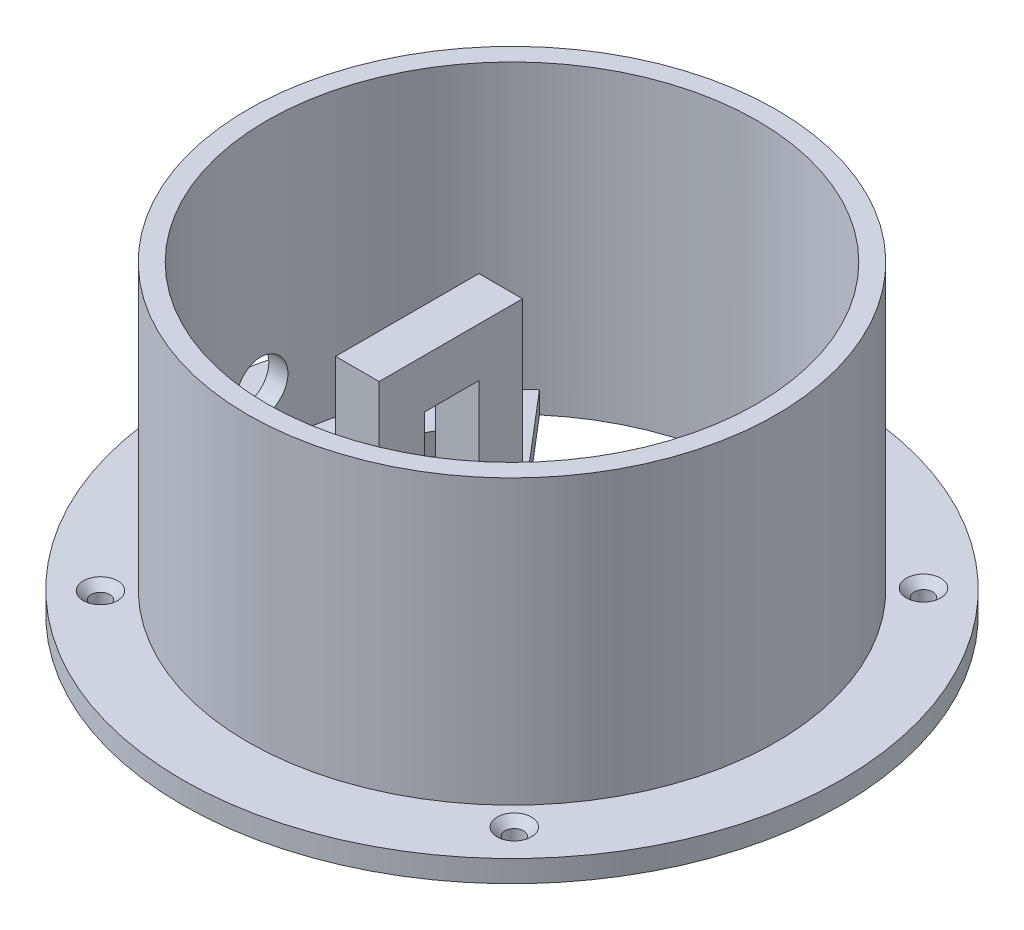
ISO-10303-21;
HEADER;
FILE_DESCRIPTION(('STEP AP214'),'2;1');
FILE_NAME('part.step','',(''),(''),'','','');
FILE_SCHEMA(('AUTOMOTIVE_DESIGN { 1 0 10303 214 1 1 1 1 }'));
ENDSEC;
DATA;
#1=APPLICATION_CONTEXT('core data for automotive mechanical design processes');
#2=APPLICATION_PROTOCOL_DEFINITION('international standard','automotive_design',2000,#1);
#3=PRODUCT_CONTEXT('',#1,'mechanical');
#4=PRODUCT('Part','Part','',(#3));
#5=PRODUCT_RELATED_PRODUCT_CATEGORY('part','',(#4));
#6=PRODUCT_DEFINITION_FORMATION('','',#4);
#7=PRODUCT_DEFINITION_CONTEXT('part definition',#1,'design');
#8=PRODUCT_DEFINITION('design','',#6,#7);
#9=PRODUCT_DEFINITION_SHAPE('','',#8);
#10=(LENGTH_UNIT() NAMED_UNIT(*) SI_UNIT(.MILLI.,.METRE.));
#11=(NAMED_UNIT(*) PLANE_ANGLE_UNIT() SI_UNIT($,.RADIAN.));
#12=(NAMED_UNIT(*) SI_UNIT($,.STERADIAN.) SOLID_ANGLE_UNIT());
#13=UNCERTAINTY_MEASURE_WITH_UNIT(LENGTH_MEASURE(1.E-05),#10,'distance_accuracy_value','');
#14=(GEOMETRIC_REPRESENTATION_CONTEXT(3) GLOBAL_UNCERTAINTY_ASSIGNED_CONTEXT((#13)) GLOBAL_UNIT_ASSIGNED_CONTEXT((#10,
#11,#12)) REPRESENTATION_CONTEXT('',''));
#15=CARTESIAN_POINT('',(0.,0.,0.));
#16=DIRECTION('',(0.,0.,1.));
#17=DIRECTION('',(1.,0.,0.));
#18=AXIS2_PLACEMENT_3D('',#15,#16,#17);
#19=CARTESIAN_POINT('',(0.,56.,0.));
#20=DIRECTION('',(0.,-1.,0.));
#21=DIRECTION('',(0.,0.,-1.));
#22=AXIS2_PLACEMENT_3D('',#19,#20,#21);
#23=CYLINDRICAL_SURFACE('',#22,45.);
#24=CARTESIAN_POINT('',(0.,4.,0.));
#25=DIRECTION('',(0.,1.,0.));
#26=DIRECTION('',(0.,0.,1.));
#27=AXIS2_PLACEMENT_3D('',#24,#25,#26);
#28=CIRCLE('',#27,45.);
#29=CARTESIAN_POINT('',(-29.2033417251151,4.,-34.2368928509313));
#30=VERTEX_POINT('',#29);
#31=CARTESIAN_POINT('',(-29.2033417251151,4.,34.2368928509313));
#32=VERTEX_POINT('',#31);
#33=EDGE_CURVE('E344',#30,#32,#28,.T.);
#34=ORIENTED_EDGE('',*,*,#33,.F.);
#35=DIRECTION('',(0.,-1.,0.));
#36=VECTOR('',#35,1.);
#37=CARTESIAN_POINT('',(-29.2033417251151,4.,-34.2368928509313));
#38=LINE('',#37,#36);
#39=CARTESIAN_POINT('',(-29.2033417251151,0.,-34.2368928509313));
#40=VERTEX_POINT('',#39);
#41=EDGE_CURVE('E379',#30,#40,#38,.T.);
#42=ORIENTED_EDGE('',*,*,#41,.T.);
#43=CARTESIAN_POINT('',(0.,0.,0.));
#44=DIRECTION('',(0.,1.,0.));
#45=DIRECTION('',(0.,0.,1.));
#46=AXIS2_PLACEMENT_3D('',#43,#44,#45);
#47=CIRCLE('',#46,45.);
#48=CARTESIAN_POINT('',(-29.2033417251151,0.,34.2368928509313));
#49=VERTEX_POINT('',#48);
#50=EDGE_CURVE('E383',#49,#40,#47,.T.);
#51=ORIENTED_EDGE('',*,*,#50,.F.);
#52=DIRECTION('',(0.,-1.,0.));
#53=VECTOR('',#52,1.);
#54=CARTESIAN_POINT('',(-29.2033417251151,4.,34.2368928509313));
#55=LINE('',#54,#53);
#56=EDGE_CURVE('E375',#32,#49,#55,.T.);
#57=ORIENTED_EDGE('',*,*,#56,.F.);
#58=EDGE_LOOP('',(#34,#42,#51,#57));
#59=FACE_BOUND('',#58,.T.);
#60=CARTESIAN_POINT('',(0.,56.,0.));
#61=DIRECTION('',(0.,1.,0.));
#62=DIRECTION('',(0.,0.,1.));
#63=AXIS2_PLACEMENT_3D('',#60,#61,#62);
#64=CIRCLE('',#63,45.);
#65=CARTESIAN_POINT('',(0.,56.,45.));
#66=VERTEX_POINT('',#65);
#67=EDGE_CURVE('E388',#66,#66,#64,.T.);
#68=ORIENTED_EDGE('',*,*,#67,.T.);
#69=EDGE_LOOP('',(#68));
#70=FACE_BOUND('',#69,.T.);
#71=CARTESIAN_POINT('',(0.,38.,0.));
#72=DIRECTION('',(0.,1.,0.));
#73=DIRECTION('',(0.,0.,1.));
#74=AXIS2_PLACEMENT_3D('',#71,#72,#73);
#75=CIRCLE('',#74,45.);
#76=CARTESIAN_POINT('',(43.0342418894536,38.,13.155));
#77=VERTEX_POINT('',#76);
#78=CARTESIAN_POINT('',(43.0342418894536,38.,-13.155));
#79=VERTEX_POINT('',#78);
#80=EDGE_CURVE('E224',#77,#79,#75,.T.);
#81=ORIENTED_EDGE('',*,*,#80,.F.);
#82=DIRECTION('',(0.,-1.,0.));
#83=VECTOR('',#82,1.);
#84=CARTESIAN_POINT('',(43.0342418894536,38.,13.155));
#85=LINE('',#84,#83);
#86=CARTESIAN_POINT('',(43.0342418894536,20.285925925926,13.155));
#87=VERTEX_POINT('',#86);
#88=EDGE_CURVE('E246',#77,#87,#85,.T.);
#89=ORIENTED_EDGE('',*,*,#88,.T.);
#90=CARTESIAN_POINT('',(0.,45.7876988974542,0.));
#91=DIRECTION('',(0.509802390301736,0.860291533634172,0.));
#92=DIRECTION('',(0.860291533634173,-0.509802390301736,0.));
#93=AXIS2_PLACEMENT_3D('',#90,#91,#92);
#94=ELLIPSE('',#93,52.3078494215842,45.);
#95=CARTESIAN_POINT('',(43.0342418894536,20.285925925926,-13.155));
#96=VERTEX_POINT('',#95);
#97=EDGE_CURVE('E11',#87,#96,#94,.T.);
#98=ORIENTED_EDGE('',*,*,#97,.T.);
#99=DIRECTION('',(0.,-1.,0.));
#100=VECTOR('',#99,1.);
#101=CARTESIAN_POINT('',(43.0342418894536,38.,-13.155));
#102=LINE('',#101,#100);
#103=EDGE_CURVE('E242',#79,#96,#102,.T.);
#104=ORIENTED_EDGE('',*,*,#103,.F.);
#105=EDGE_LOOP('',(#81,#89,#98,#104));
#106=FACE_BOUND('',#105,.T.);
#107=CARTESIAN_POINT('',(-44.5614732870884,14.,6.26698480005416));
#108=CARTESIAN_POINT('',(-44.5614727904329,14.13968580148,6.26698628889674));
#109=CARTESIAN_POINT('',(-44.5622979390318,14.2793495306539,6.26112892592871));
#110=CARTESIAN_POINT('',(-44.5655773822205,14.557721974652,6.23774465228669));
#111=CARTESIAN_POINT('',(-44.5680320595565,14.6964304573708,6.22021500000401));
#112=CARTESIAN_POINT('',(-44.5745136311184,14.9719610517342,6.17359586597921));
#113=CARTESIAN_POINT('',(-44.5785417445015,15.1087816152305,6.14449741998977));
#114=CARTESIAN_POINT('',(-44.5880729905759,15.3795072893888,6.07494678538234));
#115=CARTESIAN_POINT('',(-44.5935766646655,15.5134113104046,6.03449042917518));
#116=CARTESIAN_POINT('',(-44.6059176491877,15.7771582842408,5.9425799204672));
#117=CARTESIAN_POINT('',(-44.6127534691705,15.9070055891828,5.89113805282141));
#118=CARTESIAN_POINT('',(-44.6276011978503,16.1619351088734,5.7775850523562));
#119=CARTESIAN_POINT('',(-44.6356135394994,16.2870155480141,5.71546999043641));
#120=CARTESIAN_POINT('',(-44.6526175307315,16.5314259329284,5.58106896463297));
#121=CARTESIAN_POINT('',(-44.6616086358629,16.6507590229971,5.508788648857));
#122=CARTESIAN_POINT('',(-44.6803670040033,16.8829718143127,5.35451604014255));
#123=CARTESIAN_POINT('',(-44.6901345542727,16.9958491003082,5.27252014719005));
#124=CARTESIAN_POINT('',(-44.7102740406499,17.2149419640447,5.09892831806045));
#125=CARTESIAN_POINT('',(-44.7206490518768,17.3211167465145,5.0072812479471));
#126=CARTESIAN_POINT('',(-44.7417194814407,17.5254164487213,4.81537706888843));
#127=CARTESIAN_POINT('',(-44.7524150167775,17.6235383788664,4.71511679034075));
#128=CARTESIAN_POINT('',(-44.7738786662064,17.8109820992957,4.50674524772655));
#129=CARTESIAN_POINT('',(-44.7846467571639,17.9003065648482,4.39863638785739));
#130=CARTESIAN_POINT('',(-44.8060251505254,18.0696005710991,4.17524879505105));
#131=CARTESIAN_POINT('',(-44.8166353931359,18.1495666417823,4.05996742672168));
#132=CARTESIAN_POINT('',(-44.8375209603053,18.2999469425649,3.82243378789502));
#133=CARTESIAN_POINT('',(-44.8477941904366,18.3703078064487,3.70014753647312));
#134=CARTESIAN_POINT('',(-44.8677318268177,18.5004893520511,3.44998473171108));
#135=CARTESIAN_POINT('',(-44.8773960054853,18.5603061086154,3.32210611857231));
#136=CARTESIAN_POINT('',(-44.8959103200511,18.668911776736,3.06173844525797));
#137=CARTESIAN_POINT('',(-44.9047607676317,18.7177049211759,2.92925117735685));
#138=CARTESIAN_POINT('',(-44.9214826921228,18.8039458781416,2.66055972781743));
#139=CARTESIAN_POINT('',(-44.9293538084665,18.8413895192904,2.52435419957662));
#140=CARTESIAN_POINT('',(-44.951215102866,18.9359703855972,2.11262827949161));
#141=CARTESIAN_POINT('',(-44.963538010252,18.9758444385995,1.83282807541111));
#142=CARTESIAN_POINT('',(-44.9829430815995,19.0079349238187,1.27048292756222));
#143=CARTESIAN_POINT('',(-44.9900254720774,19.0001534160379,0.987938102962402));
#144=CARTESIAN_POINT('',(-44.9988059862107,18.9373621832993,0.429882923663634));
#145=CARTESIAN_POINT('',(-45.0005386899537,18.8826587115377,0.15433885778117));
#146=CARTESIAN_POINT('',(-44.9991690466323,18.7279600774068,-0.383701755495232));
#147=CARTESIAN_POINT('',(-44.9960667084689,18.6279649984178,-0.646198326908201));
#148=CARTESIAN_POINT('',(-44.9859966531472,18.3856335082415,-1.1505412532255));
#149=CARTESIAN_POINT('',(-44.9790317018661,18.2433274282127,-1.39240224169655));
#150=CARTESIAN_POINT('',(-44.9625820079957,17.9203780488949,-1.8489128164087));
#151=CARTESIAN_POINT('',(-44.9530971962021,17.7397336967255,-2.06356165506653));
#152=CARTESIAN_POINT('',(-44.9331230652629,17.3443165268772,-2.46053036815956));
#153=CARTESIAN_POINT('',(-44.9226295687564,17.1293991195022,-2.64270602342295));
#154=CARTESIAN_POINT('',(-44.9022822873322,16.6720427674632,-2.96846231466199));
#155=CARTESIAN_POINT('',(-44.8924285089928,16.429603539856,-3.11204255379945));
#156=CARTESIAN_POINT('',(-44.8747949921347,15.9235384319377,-3.35677381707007));
#157=CARTESIAN_POINT('',(-44.8670191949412,15.6598735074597,-3.45784441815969));
#158=CARTESIAN_POINT('',(-44.8546918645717,15.1192401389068,-3.61425319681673));
#159=CARTESIAN_POINT('',(-44.8501402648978,14.8422719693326,-3.66959231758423));
#160=CARTESIAN_POINT('',(-44.8449204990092,14.283704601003,-3.7328447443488));
#161=CARTESIAN_POINT('',(-44.8442417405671,14.0021201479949,-3.740887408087));
#162=CARTESIAN_POINT('',(-44.8468356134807,13.4416081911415,-3.70965909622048));
#163=CARTESIAN_POINT('',(-44.850108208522,13.1626806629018,-3.6703885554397));
#164=CARTESIAN_POINT('',(-44.8601305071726,12.615871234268,-3.54577869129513));
#165=CARTESIAN_POINT('',(-44.8668744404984,12.3479717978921,-3.4605158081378));
#166=CARTESIAN_POINT('',(-44.8828727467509,11.8302725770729,-3.24641194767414));
#167=CARTESIAN_POINT('',(-44.8921271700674,11.5804731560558,-3.11757009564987));
#168=CARTESIAN_POINT('',(-44.911828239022,11.1053610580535,-2.81956663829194));
#169=CARTESIAN_POINT('',(-44.9222778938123,10.8801131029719,-2.65030204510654));
#170=CARTESIAN_POINT('',(-44.9427747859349,10.4611701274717,-2.27639125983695));
#171=CARTESIAN_POINT('',(-44.9528220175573,10.2674755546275,-2.07174456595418));
#172=CARTESIAN_POINT('',(-44.9709196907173,9.91677440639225,-1.63239865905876));
#173=CARTESIAN_POINT('',(-44.9789663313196,9.75983769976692,-1.39764350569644));
#174=CARTESIAN_POINT('',(-44.991571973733,9.48761829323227,-0.905015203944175));
#175=CARTESIAN_POINT('',(-44.9961310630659,9.37233454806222,-0.64714263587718));
#176=CARTESIAN_POINT('',(-45.0006289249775,9.1870313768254,-0.116527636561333));
#177=CARTESIAN_POINT('',(-45.0005821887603,9.11687068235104,0.156165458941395));
#178=CARTESIAN_POINT('',(-44.9952540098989,9.02326445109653,0.709552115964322));
#179=CARTESIAN_POINT('',(-44.9899727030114,8.99981770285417,0.990245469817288));
#180=CARTESIAN_POINT('',(-44.9781133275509,9.00009282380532,1.41034808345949));
#181=CARTESIAN_POINT('',(-44.9735125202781,9.00606129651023,1.5500444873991));
#182=CARTESIAN_POINT('',(-44.9630550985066,9.02965836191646,1.82838784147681));
#183=CARTESIAN_POINT('',(-44.9571989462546,9.04728266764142,1.96703515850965));
#184=CARTESIAN_POINT('',(-44.9443083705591,9.09406837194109,2.24235698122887));
#185=CARTESIAN_POINT('',(-44.9372735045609,9.12323410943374,2.37903072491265));
#186=CARTESIAN_POINT('',(-44.922146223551,9.19286808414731,2.6493573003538));
#187=CARTESIAN_POINT('',(-44.9140541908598,9.23333224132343,2.78301120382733));
#188=CARTESIAN_POINT('',(-44.8969312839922,9.32541142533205,3.04681625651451));
#189=CARTESIAN_POINT('',(-44.8878976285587,9.37706000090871,3.1769555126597));
#190=CARTESIAN_POINT('',(-44.8690909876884,9.49104036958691,3.43235568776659));
#191=CARTESIAN_POINT('',(-44.8593182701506,9.55336830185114,3.55761834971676));
#192=CARTESIAN_POINT('',(-44.8392254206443,9.68830182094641,3.80249440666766));
#193=CARTESIAN_POINT('',(-44.8289050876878,9.76091119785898,3.92210569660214));
#194=CARTESIAN_POINT('',(-44.8079410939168,9.91585202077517,4.15476291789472));
#195=CARTESIAN_POINT('',(-44.7972975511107,9.99817994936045,4.26781120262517));
#196=CARTESIAN_POINT('',(-44.775838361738,10.1726158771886,4.48737716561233));
#197=CARTESIAN_POINT('',(-44.7650220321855,10.2647882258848,4.59384366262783));
#198=CARTESIAN_POINT('',(-44.7435366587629,10.457754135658,4.79859590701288));
#199=CARTESIAN_POINT('',(-44.7328675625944,10.5585445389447,4.8968846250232));
#200=CARTESIAN_POINT('',(-44.7119094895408,10.7681384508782,5.08469130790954));
#201=CARTESIAN_POINT('',(-44.7016207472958,10.876946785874,5.17420391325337));
#202=CARTESIAN_POINT('',(-44.6816730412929,11.1017226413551,5.34372323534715));
#203=CARTESIAN_POINT('',(-44.6720138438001,11.2176874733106,5.42373348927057));
#204=CARTESIAN_POINT('',(-44.6535306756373,11.4562403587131,5.57386153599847));
#205=CARTESIAN_POINT('',(-44.6447083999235,11.5788410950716,5.64395938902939));
#206=CARTESIAN_POINT('',(-44.6281361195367,11.8295419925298,5.77353733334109));
#207=CARTESIAN_POINT('',(-44.6203857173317,11.9576400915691,5.8330213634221));
#208=CARTESIAN_POINT('',(-44.6061480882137,12.2183638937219,5.94091871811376));
#209=CARTESIAN_POINT('',(-44.5996598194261,12.3509857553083,5.98934117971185));
#210=CARTESIAN_POINT('',(-44.5880995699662,12.6198605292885,6.07480301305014));
#211=CARTESIAN_POINT('',(-44.5830272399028,12.7561125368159,6.11184519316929));
#212=CARTESIAN_POINT('',(-44.5730597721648,13.0749616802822,6.18418113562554));
#213=CARTESIAN_POINT('',(-44.568730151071,13.2585627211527,6.21520104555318));
#214=CARTESIAN_POINT('',(-44.5629372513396,13.6281222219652,6.25660179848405));
#215=CARTESIAN_POINT('',(-44.561473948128,13.8140806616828,6.26698281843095));
#216=CARTESIAN_POINT('',(-44.5614732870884,14.,6.26698480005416));
#217=B_SPLINE_CURVE_WITH_KNOTS('',3,(#107,#108,#109,#110,#111,#112,#113,#114,#115,#116,#117,
#118,#119,#120,#121,#122,#123,#124,#125,#126,#127,#128,#129,#130,#131,#132,#133,#134,#135,#136,
#137,#138,#139,#140,#141,#142,#143,#144,#145,#146,#147,#148,#149,#150,#151,#152,#153,#154,#155,
#156,#157,#158,#159,#160,#161,#162,#163,#164,#165,#166,#167,#168,#169,#170,#171,#172,#173,#174,
#175,#176,#177,#178,#179,#180,#181,#182,#183,#184,#185,#186,#187,#188,#189,#190,#191,#192,#193,
#194,#195,#196,#197,#198,#199,#200,#201,#202,#203,#204,#205,#206,#207,#208,#209,#210,#211,#212,
#213,#214,#215,#216),.UNSPECIFIED.,.T.,.F.,(4,2,2,2,2,2,2,2,2,2,2,2,2,2,2,2,2,2,2,2,2,2,2,2,2,2,
2,2,2,2,2,2,2,2,2,2,2,2,2,2,2,2,2,2,2,2,2,2,2,2,2,2,2,2,4),(0.,0.418894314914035,
0.837887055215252,1.25720509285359,1.67667719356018,2.09568264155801,2.51484266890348,
2.93377071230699,3.352854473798,3.77428245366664,4.19586618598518,4.61732131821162,
5.03893223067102,5.46279775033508,5.88682072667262,6.31068060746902,6.73469608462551,
7.57896397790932,8.42319537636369,9.2619581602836,10.1007194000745,10.9388808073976,
11.7770652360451,12.6188841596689,13.4607117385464,14.3041248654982,15.1475205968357,
15.9886085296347,16.8296887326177,17.6693753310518,18.5090787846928,19.3509448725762,
20.1928229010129,21.0362884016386,21.8797327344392,22.7205234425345,23.5612923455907,
23.9805846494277,24.3997228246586,24.8190187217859,25.2381633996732,25.6585832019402,
26.0788513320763,26.4992747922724,26.9195465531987,27.3427564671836,27.7658119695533,
28.189124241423,28.612278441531,29.0362721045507,29.460108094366,29.883592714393,
30.3069727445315,30.8645184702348,31.4220594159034),.UNSPECIFIED.);
#218=CARTESIAN_POINT('',(-44.5614732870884,14.,6.26698480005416));
#219=VERTEX_POINT('',#218);
#220=EDGE_CURVE('E466',#219,#219,#217,.T.);
#221=ORIENTED_EDGE('',*,*,#220,.T.);
#222=EDGE_LOOP('',(#221));
#223=FACE_BOUND('',#222,.T.);
#224=ADVANCED_FACE('F48',(#59,#70,#106,#223),#23,.F.);
#225=CARTESIAN_POINT('',(0.,56.,0.));
#226=DIRECTION('',(0.,-1.,0.));
#227=DIRECTION('',(0.,0.,-1.));
#228=AXIS2_PLACEMENT_3D('',#225,#226,#227);
#229=CYLINDRICAL_SURFACE('',#228,48.5);
#230=CARTESIAN_POINT('',(0.,4.,0.));
#231=DIRECTION('',(0.,1.,0.));
#232=DIRECTION('',(0.,0.,1.));
#233=AXIS2_PLACEMENT_3D('',#230,#231,#232);
#234=CIRCLE('',#233,48.5);
#235=CARTESIAN_POINT('',(0.,4.,48.5));
#236=VERTEX_POINT('',#235);
#237=EDGE_CURVE('E400',#236,#236,#234,.T.);
#238=ORIENTED_EDGE('',*,*,#237,.T.);
#239=EDGE_LOOP('',(#238));
#240=FACE_BOUND('',#239,.T.);
#241=CARTESIAN_POINT('',(0.,56.,0.));
#242=DIRECTION('',(0.,1.,0.));
#243=DIRECTION('',(0.,0.,1.));
#244=AXIS2_PLACEMENT_3D('',#241,#242,#243);
#245=CIRCLE('',#244,48.5);
#246=CARTESIAN_POINT('',(0.,56.,48.5));
#247=VERTEX_POINT('',#246);
#248=EDGE_CURVE('E392',#247,#247,#245,.T.);
#249=ORIENTED_EDGE('',*,*,#248,.F.);
#250=EDGE_LOOP('',(#249));
#251=FACE_BOUND('',#250,.T.);
#252=CARTESIAN_POINT('',(-48.0933976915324,14.,6.26698480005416));
#253=CARTESIAN_POINT('',(-48.093397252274,14.1397960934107,6.26698621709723));
#254=CARTESIAN_POINT('',(-48.0941629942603,14.2795708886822,6.261119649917));
#255=CARTESIAN_POINT('',(-48.0972064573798,14.5581659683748,6.23769801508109));
#256=CARTESIAN_POINT('',(-48.0994845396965,14.6969860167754,6.22014015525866));
#257=CARTESIAN_POINT('',(-48.1055000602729,14.9727423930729,6.17344439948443));
#258=CARTESIAN_POINT('',(-48.1092386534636,15.1096771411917,6.14429733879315));
#259=CARTESIAN_POINT('',(-48.1180852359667,15.3806304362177,6.07462802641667));
#260=CARTESIAN_POINT('',(-48.1231937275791,15.5146478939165,6.03410160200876));
#261=CARTESIAN_POINT('',(-48.1346493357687,15.7786239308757,5.94202668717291));
#262=CARTESIAN_POINT('',(-48.1409951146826,15.9085867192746,5.89049009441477));
#263=CARTESIAN_POINT('',(-48.1547790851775,16.1637413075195,5.77672342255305));
#264=CARTESIAN_POINT('',(-48.1622176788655,16.2889313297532,5.7144894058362));
#265=CARTESIAN_POINT('',(-48.1780045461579,16.5335498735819,5.57982693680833));
#266=CARTESIAN_POINT('',(-48.186352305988,16.6529815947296,5.50740423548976));
#267=CARTESIAN_POINT('',(-48.2037687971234,16.8853773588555,5.35282383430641));
#268=CARTESIAN_POINT('',(-48.2128377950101,16.9983389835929,5.27066252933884));
#269=CARTESIAN_POINT('',(-48.2315293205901,17.2174924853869,5.09678902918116));
#270=CARTESIAN_POINT('',(-48.2411542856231,17.3236494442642,5.00503308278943));
#271=CARTESIAN_POINT('',(-48.2607008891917,17.5279032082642,4.81290701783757));
#272=CARTESIAN_POINT('',(-48.2706226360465,17.6259970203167,4.71253372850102));
#273=CARTESIAN_POINT('',(-48.2905325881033,17.8133713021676,4.5039353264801));
#274=CARTESIAN_POINT('',(-48.3005207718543,17.9026544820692,4.3957126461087));
#275=CARTESIAN_POINT('',(-48.3203496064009,18.0718512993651,4.17209963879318));
#276=CARTESIAN_POINT('',(-48.3301902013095,18.1517614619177,4.05670667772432));
#277=CARTESIAN_POINT('',(-48.3495514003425,18.3019535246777,3.81905132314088));
#278=CARTESIAN_POINT('',(-48.3590703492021,18.372190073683,3.69676012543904));
#279=CARTESIAN_POINT('',(-48.377542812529,18.5021249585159,3.44660560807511));
#280=CARTESIAN_POINT('',(-48.3864961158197,18.5618193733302,3.31874023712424));
#281=CARTESIAN_POINT('',(-48.4036472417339,18.6701847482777,3.05841813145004));
#282=CARTESIAN_POINT('',(-48.4118453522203,18.718859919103,2.92596317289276));
#283=CARTESIAN_POINT('',(-48.4273334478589,18.8048719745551,2.65735567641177));
#284=CARTESIAN_POINT('',(-48.4346230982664,18.8422046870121,2.52120179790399));
#285=CARTESIAN_POINT('',(-48.4548736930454,18.9364978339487,2.10953210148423));
#286=CARTESIAN_POINT('',(-48.466286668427,18.9761886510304,1.82975946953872));
#287=CARTESIAN_POINT('',(-48.4842514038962,19.007932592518,1.26752441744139));
#288=CARTESIAN_POINT('',(-48.4908033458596,18.9999874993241,0.985062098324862));
#289=CARTESIAN_POINT('',(-48.4989188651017,18.9368742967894,0.426953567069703));
#290=CARTESIAN_POINT('',(-48.500510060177,18.8819698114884,0.151278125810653));
#291=CARTESIAN_POINT('',(-48.4992035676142,18.7268236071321,-0.386981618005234));
#292=CARTESIAN_POINT('',(-48.4963058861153,18.6265819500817,-0.649565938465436));
#293=CARTESIAN_POINT('',(-48.4869242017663,18.3837026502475,-1.15406419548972));
#294=CARTESIAN_POINT('',(-48.4804423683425,18.2410906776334,-1.39599053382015));
#295=CARTESIAN_POINT('',(-48.4651449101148,17.9174884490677,-1.85256411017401));
#296=CARTESIAN_POINT('',(-48.4563292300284,17.7364972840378,-2.06721070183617));
#297=CARTESIAN_POINT('',(-48.4377798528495,17.3404801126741,-2.46397305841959));
#298=CARTESIAN_POINT('',(-48.4280428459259,17.1253293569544,-2.64596416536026));
#299=CARTESIAN_POINT('',(-48.4091725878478,16.667538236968,-2.97130448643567));
#300=CARTESIAN_POINT('',(-48.4000393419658,16.4248976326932,-3.11465336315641));
#301=CARTESIAN_POINT('',(-48.3837083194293,15.918546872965,-3.35884560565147));
#302=CARTESIAN_POINT('',(-48.3765136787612,15.6548034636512,-3.4596202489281));
#303=CARTESIAN_POINT('',(-48.3651196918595,15.1140749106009,-3.61543260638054));
#304=CARTESIAN_POINT('',(-48.3609202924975,14.8370900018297,-3.67047113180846));
#305=CARTESIAN_POINT('',(-48.3561230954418,14.2784406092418,-3.73314408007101));
#306=CARTESIAN_POINT('',(-48.3555168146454,13.9967887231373,-3.74089015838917));
#307=CARTESIAN_POINT('',(-48.3579691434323,13.436191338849,-3.70905171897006));
#308=CARTESIAN_POINT('',(-48.3610277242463,13.1572458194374,-3.66946757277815));
#309=CARTESIAN_POINT('',(-48.3703681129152,12.6103812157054,-3.54420413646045));
#310=CARTESIAN_POINT('',(-48.3766453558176,12.3424470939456,-3.45859012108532));
#311=CARTESIAN_POINT('',(-48.391523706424,11.8247400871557,-3.24375696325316));
#312=CARTESIAN_POINT('',(-48.4001248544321,11.5749675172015,-3.1145370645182));
#313=CARTESIAN_POINT('',(-48.418421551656,11.1000662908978,-2.81581465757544));
#314=CARTESIAN_POINT('',(-48.4281194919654,10.8749936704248,-2.64622321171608));
#315=CARTESIAN_POINT('',(-48.4471309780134,10.4564623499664,-2.27168756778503));
#316=CARTESIAN_POINT('',(-48.4564445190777,10.2630040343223,-2.06674293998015));
#317=CARTESIAN_POINT('',(-48.473204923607,9.91288323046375,-1.62690820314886));
#318=CARTESIAN_POINT('',(-48.480648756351,9.75628050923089,-1.39197039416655));
#319=CARTESIAN_POINT('',(-48.4922919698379,9.48475337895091,-0.899048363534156));
#320=CARTESIAN_POINT('',(-48.4964914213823,9.36982806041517,-0.641064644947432));
#321=CARTESIAN_POINT('',(-48.5005993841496,9.18520840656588,-0.11018480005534));
#322=CARTESIAN_POINT('',(-48.5005195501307,9.11539174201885,0.162668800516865));
#323=CARTESIAN_POINT('',(-48.4954977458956,9.02250642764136,0.716324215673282));
#324=CARTESIAN_POINT('',(-48.4905558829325,8.99943674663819,0.997125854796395));
#325=CARTESIAN_POINT('',(-48.4794872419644,9.00029768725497,1.41742988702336));
#326=CARTESIAN_POINT('',(-48.4751947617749,9.00647072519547,1.55723616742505));
#327=CARTESIAN_POINT('',(-48.4654437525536,9.03049623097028,1.83578674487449));
#328=CARTESIAN_POINT('',(-48.4599856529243,9.04834440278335,1.97453141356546));
#329=CARTESIAN_POINT('',(-48.4479760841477,9.09559724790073,2.25003388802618));
#330=CARTESIAN_POINT('',(-48.4414242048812,9.12500626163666,2.38679092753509));
#331=CARTESIAN_POINT('',(-48.4273399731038,9.19514593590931,2.65726762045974));
#332=CARTESIAN_POINT('',(-48.4198079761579,9.23587249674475,2.79098835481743));
#333=CARTESIAN_POINT('',(-48.4038772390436,9.3284803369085,3.05486329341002));
#334=CARTESIAN_POINT('',(-48.3954762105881,9.38039147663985,3.18500687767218));
#335=CARTESIAN_POINT('',(-48.3779914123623,9.49490725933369,3.4403960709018));
#336=CARTESIAN_POINT('',(-48.368907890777,9.55750802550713,3.56564343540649));
#337=CARTESIAN_POINT('',(-48.3502371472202,9.69299561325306,3.81046550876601));
#338=CARTESIAN_POINT('',(-48.3406497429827,9.76588617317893,3.93003813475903));
#339=CARTESIAN_POINT('',(-48.3211800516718,9.92139500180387,4.16259189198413));
#340=CARTESIAN_POINT('',(-48.3112978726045,10.0040097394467,4.27557539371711));
#341=CARTESIAN_POINT('',(-48.2913890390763,10.1789415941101,4.49487966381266));
#342=CARTESIAN_POINT('',(-48.2813618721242,10.2713144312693,4.60115594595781));
#343=CARTESIAN_POINT('',(-48.2614504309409,10.4646629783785,4.80551150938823));
#344=CARTESIAN_POINT('',(-48.2515661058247,10.5656355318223,4.90359377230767));
#345=CARTESIAN_POINT('',(-48.2321561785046,10.7755723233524,5.09097145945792));
#346=CARTESIAN_POINT('',(-48.2226307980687,10.8845413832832,5.18026150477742));
#347=CARTESIAN_POINT('',(-48.2041699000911,11.109613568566,5.34932097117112));
#348=CARTESIAN_POINT('',(-48.1952341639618,11.2257140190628,5.4290939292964));
#349=CARTESIAN_POINT('',(-48.1781442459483,11.4644848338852,5.5787184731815));
#350=CARTESIAN_POINT('',(-48.1699914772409,11.5871664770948,5.64855222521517));
#351=CARTESIAN_POINT('',(-48.1546839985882,11.8379963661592,5.77759736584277));
#352=CARTESIAN_POINT('',(-48.1475289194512,11.9661425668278,5.83681268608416));
#353=CARTESIAN_POINT('',(-48.1343925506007,12.226927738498,5.94417190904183));
#354=CARTESIAN_POINT('',(-48.1284102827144,12.3595628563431,5.99232504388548));
#355=CARTESIAN_POINT('',(-48.1177600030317,12.6284314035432,6.07725263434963));
#356=CARTESIAN_POINT('',(-48.1130916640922,12.7646639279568,6.11402992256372));
#357=CARTESIAN_POINT('',(-48.1039669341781,13.0821394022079,6.18547172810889));
#358=CARTESIAN_POINT('',(-48.1000171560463,13.2643411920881,6.21600889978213));
#359=CARTESIAN_POINT('',(-48.0947328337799,13.6310410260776,6.25676442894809));
#360=CARTESIAN_POINT('',(-48.0933982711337,13.8155390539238,6.26698293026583));
#361=CARTESIAN_POINT('',(-48.0933976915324,14.,6.26698480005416));
#362=B_SPLINE_CURVE_WITH_KNOTS('',3,(#252,#253,#254,#255,#256,#257,#258,#259,#260,#261,#262,
#263,#264,#265,#266,#267,#268,#269,#270,#271,#272,#273,#274,#275,#276,#277,#278,#279,#280,#281,
#282,#283,#284,#285,#286,#287,#288,#289,#290,#291,#292,#293,#294,#295,#296,#297,#298,#299,#300,
#301,#302,#303,#304,#305,#306,#307,#308,#309,#310,#311,#312,#313,#314,#315,#316,#317,#318,#319,
#320,#321,#322,#323,#324,#325,#326,#327,#328,#329,#330,#331,#332,#333,#334,#335,#336,#337,#338,
#339,#340,#341,#342,#343,#344,#345,#346,#347,#348,#349,#350,#351,#352,#353,#354,#355,#356,#357,
#358,#359,#360,#361),.UNSPECIFIED.,.T.,.F.,(4,2,2,2,2,2,2,2,2,2,2,2,2,2,2,2,2,2,2,2,2,2,2,2,2,2,
2,2,2,2,2,2,2,2,2,2,2,2,2,2,2,2,2,2,2,2,2,2,2,2,2,2,2,2,4),(0.,0.419226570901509,
0.838553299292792,1.25821229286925,1.67802537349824,2.09738707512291,2.51690347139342,
2.93618401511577,3.35562025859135,3.77706022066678,4.19865592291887,4.62012153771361,
5.04174291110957,5.46527811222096,5.88897051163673,6.31250073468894,6.73618655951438,
7.58018848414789,8.4241588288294,9.26342209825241,10.1026842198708,10.9414389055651,
11.7802134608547,12.6221247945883,13.4640434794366,14.3073160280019,15.150573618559,
15.9918395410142,16.83309885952,17.6731683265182,18.5132523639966,19.3552045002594,
20.197166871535,21.040485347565,21.883785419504,22.7247888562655,23.5657737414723,
23.9853919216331,24.4048557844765,24.8244772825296,25.2439469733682,25.6645507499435,
26.0850023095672,26.5056070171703,26.9260594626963,27.3490578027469,27.7719015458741,
28.1950023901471,28.6179454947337,29.0416381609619,29.4651736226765,29.8883543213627,
30.3114295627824,30.8646029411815,31.4177724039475),.UNSPECIFIED.);
#363=CARTESIAN_POINT('',(-48.0933976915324,14.,6.26698480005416));
#364=VERTEX_POINT('',#363);
#365=EDGE_CURVE('E53',#364,#364,#362,.T.);
#366=ORIENTED_EDGE('',*,*,#365,.F.);
#367=EDGE_LOOP('',(#366));
#368=FACE_BOUND('',#367,.T.);
#369=ADVANCED_FACE('F449',(#240,#251,#368),#229,.T.);
#370=CARTESIAN_POINT('',(-6.08655872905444,4.,5.19170519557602));
#371=DIRECTION('',(-0.760819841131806,0.,0.648963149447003));
#372=DIRECTION('',(0.648963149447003,0.,0.760819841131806));
#373=AXIS2_PLACEMENT_3D('',#370,#371,#372);
#374=PLANE('',#373);
#375=DIRECTION('',(-0.648963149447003,0.,-0.760819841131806));
#376=VECTOR('',#375,1.);
#377=CARTESIAN_POINT('',(-6.08655872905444,0.,5.19170519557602));
#378=LINE('',#377,#376);
#379=CARTESIAN_POINT('',(-23.22,0.,-14.8948930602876));
#380=VERTEX_POINT('',#379);
#381=CARTESIAN_POINT('',(-29.5302121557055,0.,-22.2927470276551));
#382=VERTEX_POINT('',#381);
#383=EDGE_CURVE('E76',#380,#382,#378,.T.);
#384=ORIENTED_EDGE('',*,*,#383,.F.);
#385=DIRECTION('',(0.,-1.,0.));
#386=VECTOR('',#385,1.);
#387=CARTESIAN_POINT('',(-23.22,4.,-14.8948930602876));
#388=LINE('',#387,#386);
#389=CARTESIAN_POINT('',(-23.22,4.,-14.8948930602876));
#390=VERTEX_POINT('',#389);
#391=EDGE_CURVE('E71',#390,#380,#388,.T.);
#392=ORIENTED_EDGE('',*,*,#391,.F.);
#393=DIRECTION('',(-0.648963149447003,0.,-0.760819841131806));
#394=VECTOR('',#393,1.);
#395=CARTESIAN_POINT('',(-6.08655872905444,4.,5.19170519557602));
#396=LINE('',#395,#394);
#397=CARTESIAN_POINT('',(-29.5302121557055,4.,-22.2927470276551));
#398=VERTEX_POINT('',#397);
#399=EDGE_CURVE('E335',#390,#398,#396,.T.);
#400=ORIENTED_EDGE('',*,*,#399,.T.);
#401=DIRECTION('',(0.,-1.,0.));
#402=VECTOR('',#401,1.);
#403=CARTESIAN_POINT('',(-29.5302121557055,4.,-22.2927470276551));
#404=LINE('',#403,#402);
#405=EDGE_CURVE('E372',#398,#382,#404,.T.);
#406=ORIENTED_EDGE('',*,*,#405,.T.);
#407=EDGE_LOOP('',(#384,#392,#400,#406));
#408=FACE_BOUND('',#407,.T.);
#409=ADVANCED_FACE('F455',(#408),#374,.T.);
#410=CARTESIAN_POINT('',(-6.08655872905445,4.,-5.19170519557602));
#411=DIRECTION('',(0.760819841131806,0.,0.648963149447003));
#412=DIRECTION('',(0.648963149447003,0.,-0.760819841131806));
#413=AXIS2_PLACEMENT_3D('',#410,#411,#412);
#414=PLANE('',#413);
#415=DIRECTION('',(0.,-1.,0.));
#416=VECTOR('',#415,1.);
#417=CARTESIAN_POINT('',(-23.22,4.,14.8948930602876));
#418=LINE('',#417,#416);
#419=CARTESIAN_POINT('',(-23.22,4.,14.8948930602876));
#420=VERTEX_POINT('',#419);
#421=CARTESIAN_POINT('',(-23.22,0.,14.8948930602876));
#422=VERTEX_POINT('',#421);
#423=EDGE_CURVE('E199',#420,#422,#418,.T.);
#424=ORIENTED_EDGE('',*,*,#423,.T.);
#425=DIRECTION('',(-0.648963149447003,0.,0.760819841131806));
#426=VECTOR('',#425,1.);
#427=CARTESIAN_POINT('',(-6.08655872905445,0.,-5.19170519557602));
#428=LINE('',#427,#426);
#429=CARTESIAN_POINT('',(-29.5302121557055,0.,22.2927470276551));
#430=VERTEX_POINT('',#429);
#431=EDGE_CURVE('E184',#422,#430,#428,.T.);
#432=ORIENTED_EDGE('',*,*,#431,.T.);
#433=DIRECTION('',(0.,-1.,0.));
#434=VECTOR('',#433,1.);
#435=CARTESIAN_POINT('',(-29.5302121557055,4.,22.2927470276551));
#436=LINE('',#435,#434);
#437=CARTESIAN_POINT('',(-29.5302121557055,4.,22.2927470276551));
#438=VERTEX_POINT('',#437);
#439=EDGE_CURVE('E355',#438,#430,#436,.T.);
#440=ORIENTED_EDGE('',*,*,#439,.F.);
#441=DIRECTION('',(-0.648963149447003,0.,0.760819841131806));
#442=VECTOR('',#441,1.);
#443=CARTESIAN_POINT('',(-6.08655872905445,4.,-5.19170519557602));
#444=LINE('',#443,#442);
#445=EDGE_CURVE('E201',#420,#438,#444,.T.);
#446=ORIENTED_EDGE('',*,*,#445,.F.);
#447=EDGE_LOOP('',(#424,#432,#440,#446));
#448=FACE_BOUND('',#447,.T.);
#449=ADVANCED_FACE('F200',(#448),#414,.F.);
#450=CARTESIAN_POINT('',(0.,4.,0.));
#451=DIRECTION('',(0.,1.,0.));
#452=DIRECTION('',(0.,0.,1.));
#453=AXIS2_PLACEMENT_3D('',#450,#451,#452);
#454=PLANE('',#453);
#455=ORIENTED_EDGE('',*,*,#399,.F.);
#456=DIRECTION('',(0.,0.,1.));
#457=VECTOR('',#456,1.);
#458=CARTESIAN_POINT('',(-23.22,4.,0.));
#459=LINE('',#458,#457);
#460=EDGE_CURVE('E206',#390,#420,#459,.T.);
#461=ORIENTED_EDGE('',*,*,#460,.T.);
#462=ORIENTED_EDGE('',*,*,#445,.T.);
#463=CARTESIAN_POINT('',(0.,4.,0.));
#464=DIRECTION('',(0.,1.,0.));
#465=DIRECTION('',(0.,0.,1.));
#466=AXIS2_PLACEMENT_3D('',#463,#464,#465);
#467=CIRCLE('',#466,37.);
#468=EDGE_CURVE('E331',#398,#438,#467,.T.);
#469=ORIENTED_EDGE('',*,*,#468,.F.);
#470=EDGE_LOOP('',(#455,#461,#462,#469));
#471=FACE_BOUND('',#470,.T.);
#472=DIRECTION('',(1.,0.,0.));
#473=VECTOR('',#472,1.);
#474=CARTESIAN_POINT('',(-11.22,4.,13.1539034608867));
#475=LINE('',#474,#473);
#476=CARTESIAN_POINT('',(-19.22,4.,13.1539034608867));
#477=VERTEX_POINT('',#476);
#478=CARTESIAN_POINT('',(-11.22,4.,13.1539034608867));
#479=VERTEX_POINT('',#478);
#480=EDGE_CURVE('E289',#477,#479,#475,.T.);
#481=ORIENTED_EDGE('',*,*,#480,.F.);
#482=DIRECTION('',(0.,0.,1.));
#483=VECTOR('',#482,1.);
#484=CARTESIAN_POINT('',(-19.22,4.,13.1539034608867));
#485=LINE('',#484,#483);
#486=CARTESIAN_POINT('',(-19.22,4.,4.8460965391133));
#487=VERTEX_POINT('',#486);
#488=EDGE_CURVE('E293',#487,#477,#485,.T.);
#489=ORIENTED_EDGE('',*,*,#488,.F.);
#490=DIRECTION('',(-1.,0.,0.));
#491=VECTOR('',#490,1.);
#492=CARTESIAN_POINT('',(-11.22,4.,4.8460965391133));
#493=LINE('',#492,#491);
#494=CARTESIAN_POINT('',(-11.22,4.,4.8460965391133));
#495=VERTEX_POINT('',#494);
#496=EDGE_CURVE('E296',#495,#487,#493,.T.);
#497=ORIENTED_EDGE('',*,*,#496,.F.);
#498=DIRECTION('',(0.,0.,1.));
#499=VECTOR('',#498,1.);
#500=CARTESIAN_POINT('',(-11.22,4.,0.));
#501=LINE('',#500,#499);
#502=CARTESIAN_POINT('',(-11.22,4.,-5.1539034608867));
#503=VERTEX_POINT('',#502);
#504=EDGE_CURVE('E351',#503,#495,#501,.T.);
#505=ORIENTED_EDGE('',*,*,#504,.F.);
#506=DIRECTION('',(1.,0.,0.));
#507=VECTOR('',#506,1.);
#508=CARTESIAN_POINT('',(-11.22,4.,-5.1539034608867));
#509=LINE('',#508,#507);
#510=CARTESIAN_POINT('',(-19.22,4.,-5.1539034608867));
#511=VERTEX_POINT('',#510);
#512=EDGE_CURVE('E309',#511,#503,#509,.T.);
#513=ORIENTED_EDGE('',*,*,#512,.F.);
#514=DIRECTION('',(0.,0.,1.));
#515=VECTOR('',#514,1.);
#516=CARTESIAN_POINT('',(-19.22,4.,-13.1539034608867));
#517=LINE('',#516,#515);
#518=CARTESIAN_POINT('',(-19.22,4.,-13.1539034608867));
#519=VERTEX_POINT('',#518);
#520=EDGE_CURVE('E312',#519,#511,#517,.T.);
#521=ORIENTED_EDGE('',*,*,#520,.F.);
#522=DIRECTION('',(-1.,0.,0.));
#523=VECTOR('',#522,1.);
#524=CARTESIAN_POINT('',(-11.22,4.,-13.1539034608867));
#525=LINE('',#524,#523);
#526=CARTESIAN_POINT('',(-11.22,4.,-13.1539034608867));
#527=VERTEX_POINT('',#526);
#528=EDGE_CURVE('E300',#527,#519,#525,.T.);
#529=ORIENTED_EDGE('',*,*,#528,.F.);
#530=DIRECTION('',(-0.648963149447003,0.,-0.760819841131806));
#531=VECTOR('',#530,1.);
#532=CARTESIAN_POINT('',(0.,4.,0.));
#533=LINE('',#532,#531);
#534=EDGE_CURVE('E341',#527,#30,#533,.T.);
#535=ORIENTED_EDGE('',*,*,#534,.T.);
#536=ORIENTED_EDGE('',*,*,#33,.T.);
#537=DIRECTION('',(-0.648963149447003,0.,0.760819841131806));
#538=VECTOR('',#537,1.);
#539=CARTESIAN_POINT('',(0.,4.,0.));
#540=LINE('',#539,#538);
#541=EDGE_CURVE('E347',#479,#32,#540,.T.);
#542=ORIENTED_EDGE('',*,*,#541,.F.);
#543=EDGE_LOOP('',(#481,#489,#497,#505,#513,#521,#529,#535,#536,#542));
#544=FACE_BOUND('',#543,.T.);
#545=ADVANCED_FACE('F695',(#471,#544),#454,.T.);
#546=CARTESIAN_POINT('',(0.,4.,0.));
#547=DIRECTION('',(0.,-1.,0.));
#548=DIRECTION('',(0.,0.,-1.));
#549=AXIS2_PLACEMENT_3D('',#546,#547,#548);
#550=CYLINDRICAL_SURFACE('',#549,60.5);
#551=CARTESIAN_POINT('',(0.,4.,0.));
#552=DIRECTION('',(0.,1.,0.));
#553=DIRECTION('',(0.,0.,1.));
#554=AXIS2_PLACEMENT_3D('',#551,#552,#553);
#555=CIRCLE('',#554,60.5);
#556=CARTESIAN_POINT('',(0.,4.,60.5));
#557=VERTEX_POINT('',#556);
#558=EDGE_CURVE('E404',#557,#557,#555,.T.);
#559=ORIENTED_EDGE('',*,*,#558,.F.);
#560=EDGE_LOOP('',(#559));
#561=FACE_BOUND('',#560,.T.);
#562=CARTESIAN_POINT('',(0.,0.,0.));
#563=DIRECTION('',(0.,1.,0.));
#564=DIRECTION('',(0.,0.,1.));
#565=AXIS2_PLACEMENT_3D('',#562,#563,#564);
#566=CIRCLE('',#565,60.5);
#567=CARTESIAN_POINT('',(0.,0.,60.5));
#568=VERTEX_POINT('',#567);
#569=EDGE_CURVE('E396',#568,#568,#566,.T.);
#570=ORIENTED_EDGE('',*,*,#569,.T.);
#571=EDGE_LOOP('',(#570));
#572=FACE_BOUND('',#571,.T.);
#573=ADVANCED_FACE('F625',(#561,#572),#550,.T.);
#574=CARTESIAN_POINT('',(0.,4.,0.));
#575=DIRECTION('',(0.,1.,0.));
#576=DIRECTION('',(0.,0.,1.));
#577=AXIS2_PLACEMENT_3D('',#574,#575,#576);
#578=PLANE('',#577);
#579=CARTESIAN_POINT('',(37.5452553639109,4.,-37.9671121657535));
#580=DIRECTION('',(0.,1.,0.));
#581=DIRECTION('',(0.,0.,1.));
#582=AXIS2_PLACEMENT_3D('',#579,#580,#581);
#583=CIRCLE('',#582,3.15);
#584=CARTESIAN_POINT('',(37.5452553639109,4.,-34.8171121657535));
#585=VERTEX_POINT('',#584);
#586=EDGE_CURVE('E473',#585,#585,#583,.T.);
#587=ORIENTED_EDGE('',*,*,#586,.F.);
#588=EDGE_LOOP('',(#587));
#589=FACE_BOUND('',#588,.T.);
#590=CARTESIAN_POINT('',(37.9671121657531,4.,37.5452553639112));
#591=DIRECTION('',(0.,1.,0.));
#592=DIRECTION('',(0.,0.,1.));
#593=AXIS2_PLACEMENT_3D('',#590,#591,#592);
#594=CIRCLE('',#593,3.15);
#595=CARTESIAN_POINT('',(37.9671121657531,4.,40.6952553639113));
#596=VERTEX_POINT('',#595);
#597=EDGE_CURVE('E993',#596,#596,#594,.T.);
#598=ORIENTED_EDGE('',*,*,#597,.F.);
#599=EDGE_LOOP('',(#598));
#600=FACE_BOUND('',#599,.T.);
#601=CARTESIAN_POINT('',(-37.5452553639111,4.,37.9671121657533));
#602=DIRECTION('',(0.,1.,0.));
#603=DIRECTION('',(0.,0.,1.));
#604=AXIS2_PLACEMENT_3D('',#601,#602,#603);
#605=CIRCLE('',#604,3.15);
#606=CARTESIAN_POINT('',(-37.5452553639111,4.,41.1171121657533));
#607=VERTEX_POINT('',#606);
#608=EDGE_CURVE('E1005',#607,#607,#605,.T.);
#609=ORIENTED_EDGE('',*,*,#608,.F.);
#610=EDGE_LOOP('',(#609));
#611=FACE_BOUND('',#610,.T.);
#612=CARTESIAN_POINT('',(-37.9671121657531,4.,-37.5452553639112));
#613=DIRECTION('',(0.,1.,0.));
#614=DIRECTION('',(0.,0.,1.));
#615=AXIS2_PLACEMENT_3D('',#612,#613,#614);
#616=CIRCLE('',#615,3.15);
#617=CARTESIAN_POINT('',(-37.9671121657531,4.,-34.3952553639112));
#618=VERTEX_POINT('',#617);
#619=EDGE_CURVE('E1017',#618,#618,#616,.T.);
#620=ORIENTED_EDGE('',*,*,#619,.F.);
#621=EDGE_LOOP('',(#620));
#622=FACE_BOUND('',#621,.T.);
#623=ORIENTED_EDGE('',*,*,#237,.F.);
#624=EDGE_LOOP('',(#623));
#625=FACE_BOUND('',#624,.T.);
#626=ORIENTED_EDGE('',*,*,#558,.T.);
#627=EDGE_LOOP('',(#626));
#628=FACE_BOUND('',#627,.T.);
#629=ADVANCED_FACE('F463',(#589,#600,#611,#622,#625,#628),#578,.T.);
#630=CARTESIAN_POINT('',(0.,0.,0.));
#631=DIRECTION('',(0.,1.,0.));
#632=DIRECTION('',(0.,0.,1.));
#633=AXIS2_PLACEMENT_3D('',#630,#631,#632);
#634=PLANE('',#633);
#635=CARTESIAN_POINT('',(37.5452553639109,0.,-37.9671121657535));
#636=DIRECTION('',(0.,1.,0.));
#637=DIRECTION('',(0.,0.,1.));
#638=AXIS2_PLACEMENT_3D('',#635,#636,#637);
#639=CIRCLE('',#638,1.7);
#640=CARTESIAN_POINT('',(37.5452553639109,0.,-36.2671121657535));
#641=VERTEX_POINT('',#640);
#642=EDGE_CURVE('E990',#641,#641,#639,.T.);
#643=ORIENTED_EDGE('',*,*,#642,.T.);
#644=EDGE_LOOP('',(#643));
#645=FACE_BOUND('',#644,.T.);
#646=CARTESIAN_POINT('',(37.9671121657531,0.,37.5452553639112));
#647=DIRECTION('',(0.,1.,0.));
#648=DIRECTION('',(0.,0.,1.));
#649=AXIS2_PLACEMENT_3D('',#646,#647,#648);
#650=CIRCLE('',#649,1.7);
#651=CARTESIAN_POINT('',(37.9671121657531,0.,39.2452553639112));
#652=VERTEX_POINT('',#651);
#653=EDGE_CURVE('E1001',#652,#652,#650,.T.);
#654=ORIENTED_EDGE('',*,*,#653,.T.);
#655=EDGE_LOOP('',(#654));
#656=FACE_BOUND('',#655,.T.);
#657=CARTESIAN_POINT('',(-37.5452553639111,0.,37.9671121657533));
#658=DIRECTION('',(0.,1.,0.));
#659=DIRECTION('',(0.,0.,1.));
#660=AXIS2_PLACEMENT_3D('',#657,#658,#659);
#661=CIRCLE('',#660,1.7);
#662=CARTESIAN_POINT('',(-37.5452553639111,0.,39.6671121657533));
#663=VERTEX_POINT('',#662);
#664=EDGE_CURVE('E1013',#663,#663,#661,.T.);
#665=ORIENTED_EDGE('',*,*,#664,.T.);
#666=EDGE_LOOP('',(#665));
#667=FACE_BOUND('',#666,.T.);
#668=CARTESIAN_POINT('',(-37.9671121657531,0.,-37.5452553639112));
#669=DIRECTION('',(0.,1.,0.));
#670=DIRECTION('',(0.,0.,1.));
#671=AXIS2_PLACEMENT_3D('',#668,#669,#670);
#672=CIRCLE('',#671,1.7);
#673=CARTESIAN_POINT('',(-37.9671121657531,0.,-35.8452553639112));
#674=VERTEX_POINT('',#673);
#675=EDGE_CURVE('E210',#674,#674,#672,.T.);
#676=ORIENTED_EDGE('',*,*,#675,.T.);
#677=EDGE_LOOP('',(#676));
#678=FACE_BOUND('',#677,.T.);
#679=DIRECTION('',(0.,0.,1.));
#680=VECTOR('',#679,1.);
#681=CARTESIAN_POINT('',(-23.22,0.,0.));
#682=LINE('',#681,#680);
#683=EDGE_CURVE('E189',#380,#422,#682,.T.);
#684=ORIENTED_EDGE('',*,*,#683,.F.);
#685=ORIENTED_EDGE('',*,*,#383,.T.);
#686=CARTESIAN_POINT('',(0.,0.,0.));
#687=DIRECTION('',(0.,1.,0.));
#688=DIRECTION('',(0.,0.,1.));
#689=AXIS2_PLACEMENT_3D('',#686,#687,#688);
#690=CIRCLE('',#689,37.);
#691=EDGE_CURVE('E191',#382,#430,#690,.T.);
#692=ORIENTED_EDGE('',*,*,#691,.T.);
#693=ORIENTED_EDGE('',*,*,#431,.F.);
#694=EDGE_LOOP('',(#684,#685,#692,#693));
#695=FACE_BOUND('',#694,.T.);
#696=ORIENTED_EDGE('',*,*,#569,.F.);
#697=EDGE_LOOP('',(#696));
#698=FACE_BOUND('',#697,.T.);
#699=ORIENTED_EDGE('',*,*,#50,.T.);
#700=DIRECTION('',(-0.648963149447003,0.,-0.760819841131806));
#701=VECTOR('',#700,1.);
#702=CARTESIAN_POINT('',(0.,0.,0.));
#703=LINE('',#702,#701);
#704=CARTESIAN_POINT('',(-11.22,0.,-13.1539034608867));
#705=VERTEX_POINT('',#704);
#706=EDGE_CURVE('E196',#705,#40,#703,.T.);
#707=ORIENTED_EDGE('',*,*,#706,.F.);
#708=DIRECTION('',(0.,0.,1.));
#709=VECTOR('',#708,1.);
#710=CARTESIAN_POINT('',(-11.22,0.,0.));
#711=LINE('',#710,#709);
#712=CARTESIAN_POINT('',(-11.22,0.,13.1539034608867));
#713=VERTEX_POINT('',#712);
#714=EDGE_CURVE('E336',#705,#713,#711,.T.);
#715=ORIENTED_EDGE('',*,*,#714,.T.);
#716=DIRECTION('',(-0.648963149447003,0.,0.760819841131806));
#717=VECTOR('',#716,1.);
#718=CARTESIAN_POINT('',(0.,0.,0.));
#719=LINE('',#718,#717);
#720=EDGE_CURVE('E362',#713,#49,#719,.T.);
#721=ORIENTED_EDGE('',*,*,#720,.T.);
#722=EDGE_LOOP('',(#699,#707,#715,#721));
#723=FACE_BOUND('',#722,.T.);
#724=ADVANCED_FACE('F186',(#645,#656,#667,#678,#695,#698,#723),#634,.F.);
#725=CARTESIAN_POINT('',(0.,56.,0.));
#726=DIRECTION('',(0.,1.,0.));
#727=DIRECTION('',(0.,0.,1.));
#728=AXIS2_PLACEMENT_3D('',#725,#726,#727);
#729=PLANE('',#728);
#730=ORIENTED_EDGE('',*,*,#67,.F.);
#731=EDGE_LOOP('',(#730));
#732=FACE_BOUND('',#731,.T.);
#733=ORIENTED_EDGE('',*,*,#248,.T.);
#734=EDGE_LOOP('',(#733));
#735=FACE_BOUND('',#734,.T.);
#736=ADVANCED_FACE('F612',(#732,#735),#729,.T.);
#737=CARTESIAN_POINT('',(0.,4.,0.));
#738=DIRECTION('',(-0.760819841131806,0.,0.648963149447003));
#739=DIRECTION('',(0.648963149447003,0.,0.760819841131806));
#740=AXIS2_PLACEMENT_3D('',#737,#738,#739);
#741=PLANE('',#740);
#742=ORIENTED_EDGE('',*,*,#706,.T.);
#743=ORIENTED_EDGE('',*,*,#41,.F.);
#744=ORIENTED_EDGE('',*,*,#534,.F.);
#745=DIRECTION('',(0.,-1.,0.));
#746=VECTOR('',#745,1.);
#747=CARTESIAN_POINT('',(-11.22,4.,-13.1539034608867));
#748=LINE('',#747,#746);
#749=EDGE_CURVE('E368',#527,#705,#748,.T.);
#750=ORIENTED_EDGE('',*,*,#749,.T.);
#751=EDGE_LOOP('',(#742,#743,#744,#750));
#752=FACE_BOUND('',#751,.T.);
#753=ADVANCED_FACE('F822',(#752),#741,.F.);
#754=CARTESIAN_POINT('',(0.,4.,0.));
#755=DIRECTION('',(0.760819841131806,0.,0.648963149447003));
#756=DIRECTION('',(0.648963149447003,0.,-0.760819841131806));
#757=AXIS2_PLACEMENT_3D('',#754,#755,#756);
#758=PLANE('',#757);
#759=ORIENTED_EDGE('',*,*,#720,.F.);
#760=DIRECTION('',(0.,-1.,0.));
#761=VECTOR('',#760,1.);
#762=CARTESIAN_POINT('',(-11.22,4.,13.1539034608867));
#763=LINE('',#762,#761);
#764=EDGE_CURVE('E371',#479,#713,#763,.T.);
#765=ORIENTED_EDGE('',*,*,#764,.F.);
#766=ORIENTED_EDGE('',*,*,#541,.T.);
#767=ORIENTED_EDGE('',*,*,#56,.T.);
#768=EDGE_LOOP('',(#759,#765,#766,#767));
#769=FACE_BOUND('',#768,.T.);
#770=ADVANCED_FACE('F816',(#769),#758,.T.);
#771=CARTESIAN_POINT('',(0.,4.,0.));
#772=DIRECTION('',(0.,-1.,0.));
#773=DIRECTION('',(0.,0.,-1.));
#774=AXIS2_PLACEMENT_3D('',#771,#772,#773);
#775=CYLINDRICAL_SURFACE('',#774,37.);
#776=ORIENTED_EDGE('',*,*,#691,.F.);
#777=ORIENTED_EDGE('',*,*,#405,.F.);
#778=ORIENTED_EDGE('',*,*,#468,.T.);
#779=ORIENTED_EDGE('',*,*,#439,.T.);
#780=EDGE_LOOP('',(#776,#777,#778,#779));
#781=FACE_BOUND('',#780,.T.);
#782=ADVANCED_FACE('F685',(#781),#775,.F.);
#783=CARTESIAN_POINT('',(-19.22,4.,0.));
#784=DIRECTION('',(1.,0.,0.));
#785=DIRECTION('',(0.,0.,-1.));
#786=AXIS2_PLACEMENT_3D('',#783,#784,#785);
#787=PLANE('',#786);
#788=ORIENTED_EDGE('',*,*,#520,.T.);
#789=DIRECTION('',(0.,-1.,0.));
#790=VECTOR('',#789,1.);
#791=CARTESIAN_POINT('',(-19.22,29.,-5.1539034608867));
#792=LINE('',#791,#790);
#793=CARTESIAN_POINT('',(-19.22,29.,-5.1539034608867));
#794=VERTEX_POINT('',#793);
#795=EDGE_CURVE('E320',#794,#511,#792,.T.);
#796=ORIENTED_EDGE('',*,*,#795,.F.);
#797=DIRECTION('',(0.,0.,1.));
#798=VECTOR('',#797,1.);
#799=CARTESIAN_POINT('',(-19.22,29.,-13.1539034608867));
#800=LINE('',#799,#798);
#801=CARTESIAN_POINT('',(-19.22,29.,4.8460965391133));
#802=VERTEX_POINT('',#801);
#803=EDGE_CURVE('E250',#794,#802,#800,.T.);
#804=ORIENTED_EDGE('',*,*,#803,.T.);
#805=DIRECTION('',(0.,-1.,0.));
#806=VECTOR('',#805,1.);
#807=CARTESIAN_POINT('',(-19.22,29.,4.8460965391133));
#808=LINE('',#807,#806);
#809=EDGE_CURVE('E277',#802,#487,#808,.T.);
#810=ORIENTED_EDGE('',*,*,#809,.T.);
#811=ORIENTED_EDGE('',*,*,#488,.T.);
#812=DIRECTION('',(0.,-1.,0.));
#813=VECTOR('',#812,1.);
#814=CARTESIAN_POINT('',(-19.22,29.,13.1539034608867));
#815=LINE('',#814,#813);
#816=CARTESIAN_POINT('',(-19.22,38.,13.1539034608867));
#817=VERTEX_POINT('',#816);
#818=EDGE_CURVE('E281',#817,#477,#815,.T.);
#819=ORIENTED_EDGE('',*,*,#818,.F.);
#820=DIRECTION('',(0.,0.,1.));
#821=VECTOR('',#820,1.);
#822=CARTESIAN_POINT('',(-19.22,38.,-13.1539034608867));
#823=LINE('',#822,#821);
#824=CARTESIAN_POINT('',(-19.22,38.,-13.1539034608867));
#825=VERTEX_POINT('',#824);
#826=EDGE_CURVE('E251',#825,#817,#823,.T.);
#827=ORIENTED_EDGE('',*,*,#826,.F.);
#828=DIRECTION('',(0.,-1.,0.));
#829=VECTOR('',#828,1.);
#830=CARTESIAN_POINT('',(-19.22,29.,-13.1539034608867));
#831=LINE('',#830,#829);
#832=EDGE_CURVE('E324',#825,#519,#831,.T.);
#833=ORIENTED_EDGE('',*,*,#832,.T.);
#834=EDGE_LOOP('',(#788,#796,#804,#810,#811,#819,#827,#833));
#835=FACE_BOUND('',#834,.T.);
#836=ADVANCED_FACE('F678',(#835),#787,.F.);
#837=CARTESIAN_POINT('',(-11.22,4.,0.));
#838=DIRECTION('',(1.,0.,0.));
#839=DIRECTION('',(0.,0.,-1.));
#840=AXIS2_PLACEMENT_3D('',#837,#838,#839);
#841=PLANE('',#840);
#842=DIRECTION('',(0.,-1.,0.));
#843=VECTOR('',#842,1.);
#844=CARTESIAN_POINT('',(-11.22,29.,-13.1539034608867));
#845=LINE('',#844,#843);
#846=CARTESIAN_POINT('',(-11.22,38.,-13.1539034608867));
#847=VERTEX_POINT('',#846);
#848=EDGE_CURVE('E328',#847,#527,#845,.T.);
#849=ORIENTED_EDGE('',*,*,#848,.F.);
#850=DIRECTION('',(0.,0.,-1.));
#851=VECTOR('',#850,1.);
#852=CARTESIAN_POINT('',(-11.22,38.,-13.1539034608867));
#853=LINE('',#852,#851);
#854=CARTESIAN_POINT('',(-11.22,38.,13.1539034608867));
#855=VERTEX_POINT('',#854);
#856=EDGE_CURVE('E260',#855,#847,#853,.T.);
#857=ORIENTED_EDGE('',*,*,#856,.F.);
#858=DIRECTION('',(0.,-1.,0.));
#859=VECTOR('',#858,1.);
#860=CARTESIAN_POINT('',(-11.22,29.,13.1539034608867));
#861=LINE('',#860,#859);
#862=EDGE_CURVE('E285',#855,#479,#861,.T.);
#863=ORIENTED_EDGE('',*,*,#862,.T.);
#864=ORIENTED_EDGE('',*,*,#764,.T.);
#865=ORIENTED_EDGE('',*,*,#714,.F.);
#866=ORIENTED_EDGE('',*,*,#749,.F.);
#867=EDGE_LOOP('',(#849,#857,#863,#864,#865,#866));
#868=FACE_BOUND('',#867,.T.);
#869=DIRECTION('',(0.,0.,-1.));
#870=VECTOR('',#869,1.);
#871=CARTESIAN_POINT('',(-11.22,29.,-13.1539034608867));
#872=LINE('',#871,#870);
#873=CARTESIAN_POINT('',(-11.22,29.,4.8460965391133));
#874=VERTEX_POINT('',#873);
#875=CARTESIAN_POINT('',(-11.22,29.,-5.1539034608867));
#876=VERTEX_POINT('',#875);
#877=EDGE_CURVE('E256',#874,#876,#872,.T.);
#878=ORIENTED_EDGE('',*,*,#877,.T.);
#879=DIRECTION('',(0.,-1.,0.));
#880=VECTOR('',#879,1.);
#881=CARTESIAN_POINT('',(-11.22,29.,-5.1539034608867));
#882=LINE('',#881,#880);
#883=EDGE_CURVE('E308',#876,#503,#882,.T.);
#884=ORIENTED_EDGE('',*,*,#883,.T.);
#885=ORIENTED_EDGE('',*,*,#504,.T.);
#886=DIRECTION('',(0.,-1.,0.));
#887=VECTOR('',#886,1.);
#888=CARTESIAN_POINT('',(-11.22,29.,4.8460965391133));
#889=LINE('',#888,#887);
#890=EDGE_CURVE('E268',#874,#495,#889,.T.);
#891=ORIENTED_EDGE('',*,*,#890,.F.);
#892=EDGE_LOOP('',(#878,#884,#885,#891));
#893=FACE_BOUND('',#892,.T.);
#894=ADVANCED_FACE('F684',(#868,#893),#841,.T.);
#895=CARTESIAN_POINT('',(-11.22,29.,-13.1539034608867));
#896=DIRECTION('',(0.,0.,1.));
#897=DIRECTION('',(1.,0.,0.));
#898=AXIS2_PLACEMENT_3D('',#895,#896,#897);
#899=PLANE('',#898);
#900=ORIENTED_EDGE('',*,*,#528,.T.);
#901=ORIENTED_EDGE('',*,*,#832,.F.);
#902=DIRECTION('',(-1.,0.,0.));
#903=VECTOR('',#902,1.);
#904=CARTESIAN_POINT('',(-19.22,38.,-13.1539034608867));
#905=LINE('',#904,#903);
#906=EDGE_CURVE('E264',#847,#825,#905,.T.);
#907=ORIENTED_EDGE('',*,*,#906,.F.);
#908=ORIENTED_EDGE('',*,*,#848,.T.);
#909=EDGE_LOOP('',(#900,#901,#907,#908));
#910=FACE_BOUND('',#909,.T.);
#911=ADVANCED_FACE('F669',(#910),#899,.F.);
#912=CARTESIAN_POINT('',(-11.22,29.,-5.1539034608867));
#913=DIRECTION('',(0.,0.,-1.));
#914=DIRECTION('',(-1.,0.,0.));
#915=AXIS2_PLACEMENT_3D('',#912,#913,#914);
#916=PLANE('',#915);
#917=ORIENTED_EDGE('',*,*,#512,.T.);
#918=ORIENTED_EDGE('',*,*,#883,.F.);
#919=DIRECTION('',(1.,0.,0.));
#920=VECTOR('',#919,1.);
#921=CARTESIAN_POINT('',(-11.22,29.,-5.1539034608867));
#922=LINE('',#921,#920);
#923=EDGE_CURVE('E304',#794,#876,#922,.T.);
#924=ORIENTED_EDGE('',*,*,#923,.F.);
#925=ORIENTED_EDGE('',*,*,#795,.T.);
#926=EDGE_LOOP('',(#917,#918,#924,#925));
#927=FACE_BOUND('',#926,.T.);
#928=ADVANCED_FACE('F655',(#927),#916,.F.);
#929=CARTESIAN_POINT('',(-11.22,29.,4.8460965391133));
#930=DIRECTION('',(0.,0.,1.));
#931=DIRECTION('',(1.,0.,0.));
#932=AXIS2_PLACEMENT_3D('',#929,#930,#931);
#933=PLANE('',#932);
#934=ORIENTED_EDGE('',*,*,#496,.T.);
#935=ORIENTED_EDGE('',*,*,#809,.F.);
#936=DIRECTION('',(-1.,0.,0.));
#937=VECTOR('',#936,1.);
#938=CARTESIAN_POINT('',(-11.22,29.,4.8460965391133));
#939=LINE('',#938,#937);
#940=EDGE_CURVE('E288',#874,#802,#939,.T.);
#941=ORIENTED_EDGE('',*,*,#940,.F.);
#942=ORIENTED_EDGE('',*,*,#890,.T.);
#943=EDGE_LOOP('',(#934,#935,#941,#942));
#944=FACE_BOUND('',#943,.T.);
#945=ADVANCED_FACE('F648',(#944),#933,.F.);
#946=CARTESIAN_POINT('',(-11.22,29.,13.1539034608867));
#947=DIRECTION('',(0.,0.,-1.));
#948=DIRECTION('',(-1.,0.,0.));
#949=AXIS2_PLACEMENT_3D('',#946,#947,#948);
#950=PLANE('',#949);
#951=ORIENTED_EDGE('',*,*,#480,.T.);
#952=ORIENTED_EDGE('',*,*,#862,.F.);
#953=DIRECTION('',(1.,0.,0.));
#954=VECTOR('',#953,1.);
#955=CARTESIAN_POINT('',(-19.22,38.,13.1539034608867));
#956=LINE('',#955,#954);
#957=EDGE_CURVE('E255',#817,#855,#956,.T.);
#958=ORIENTED_EDGE('',*,*,#957,.F.);
#959=ORIENTED_EDGE('',*,*,#818,.T.);
#960=EDGE_LOOP('',(#951,#952,#958,#959));
#961=FACE_BOUND('',#960,.T.);
#962=ADVANCED_FACE('F654',(#961),#950,.F.);
#963=CARTESIAN_POINT('',(0.,29.,0.));
#964=DIRECTION('',(0.,1.,0.));
#965=DIRECTION('',(0.,0.,1.));
#966=AXIS2_PLACEMENT_3D('',#963,#964,#965);
#967=PLANE('',#966);
#968=ORIENTED_EDGE('',*,*,#803,.F.);
#969=ORIENTED_EDGE('',*,*,#923,.T.);
#970=ORIENTED_EDGE('',*,*,#877,.F.);
#971=ORIENTED_EDGE('',*,*,#940,.T.);
#972=EDGE_LOOP('',(#968,#969,#970,#971));
#973=FACE_BOUND('',#972,.T.);
#974=ADVANCED_FACE('F771',(#973),#967,.F.);
#975=CARTESIAN_POINT('',(0.,38.,0.));
#976=DIRECTION('',(0.,1.,0.));
#977=DIRECTION('',(0.,0.,1.));
#978=AXIS2_PLACEMENT_3D('',#975,#976,#977);
#979=PLANE('',#978);
#980=ORIENTED_EDGE('',*,*,#826,.T.);
#981=ORIENTED_EDGE('',*,*,#957,.T.);
#982=ORIENTED_EDGE('',*,*,#856,.T.);
#983=ORIENTED_EDGE('',*,*,#906,.T.);
#984=EDGE_LOOP('',(#980,#981,#982,#983));
#985=FACE_BOUND('',#984,.T.);
#986=ADVANCED_FACE('F754',(#985),#979,.T.);
#987=CARTESIAN_POINT('',(0.,38.,13.155));
#988=DIRECTION('',(0.,0.,-1.));
#989=DIRECTION('',(-1.,0.,0.));
#990=AXIS2_PLACEMENT_3D('',#987,#988,#989);
#991=PLANE('',#990);
#992=DIRECTION('',(0.,-1.,0.));
#993=VECTOR('',#992,1.);
#994=CARTESIAN_POINT('',(31.7042418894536,38.,13.155));
#995=LINE('',#994,#993);
#996=CARTESIAN_POINT('',(31.7042418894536,38.,13.155));
#997=VERTEX_POINT('',#996);
#998=CARTESIAN_POINT('',(31.7042418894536,27.0000000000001,13.155));
#999=VERTEX_POINT('',#998);
#1000=EDGE_CURVE('E234',#997,#999,#995,.T.);
#1001=ORIENTED_EDGE('',*,*,#1000,.T.);
#1002=DIRECTION('',(-0.860291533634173,0.509802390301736,0.));
#1003=VECTOR('',#1002,1.);
#1004=CARTESIAN_POINT('',(31.7042418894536,27.0000000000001,13.155));
#1005=LINE('',#1004,#1003);
#1006=EDGE_CURVE('E415',#999,#87,#1005,.F.);
#1007=ORIENTED_EDGE('',*,*,#1006,.T.);
#1008=ORIENTED_EDGE('',*,*,#88,.F.);
#1009=DIRECTION('',(1.,0.,0.));
#1010=VECTOR('',#1009,1.);
#1011=CARTESIAN_POINT('',(0.,38.,13.155));
#1012=LINE('',#1011,#1010);
#1013=EDGE_CURVE('E221',#997,#77,#1012,.T.);
#1014=ORIENTED_EDGE('',*,*,#1013,.F.);
#1015=EDGE_LOOP('',(#1001,#1007,#1008,#1014));
#1016=FACE_BOUND('',#1015,.T.);
#1017=ADVANCED_FACE('F433',(#1016),#991,.F.);
#1018=CARTESIAN_POINT('',(0.,38.,-13.155));
#1019=DIRECTION('',(0.,0.,-1.));
#1020=DIRECTION('',(-1.,0.,0.));
#1021=AXIS2_PLACEMENT_3D('',#1018,#1019,#1020);
#1022=PLANE('',#1021);
#1023=ORIENTED_EDGE('',*,*,#103,.T.);
#1024=DIRECTION('',(0.860291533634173,-0.509802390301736,0.));
#1025=VECTOR('',#1024,1.);
#1026=CARTESIAN_POINT('',(3.41551870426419,43.7636878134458,-13.155));
#1027=LINE('',#1026,#1025);
#1028=CARTESIAN_POINT('',(31.7042418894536,27.0000000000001,-13.155));
#1029=VERTEX_POINT('',#1028);
#1030=EDGE_CURVE('E64',#96,#1029,#1027,.F.);
#1031=ORIENTED_EDGE('',*,*,#1030,.T.);
#1032=DIRECTION('',(0.,-1.,0.));
#1033=VECTOR('',#1032,1.);
#1034=CARTESIAN_POINT('',(31.7042418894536,38.,-13.155));
#1035=LINE('',#1034,#1033);
#1036=CARTESIAN_POINT('',(31.7042418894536,38.,-13.155));
#1037=VERTEX_POINT('',#1036);
#1038=EDGE_CURVE('E238',#1037,#1029,#1035,.T.);
#1039=ORIENTED_EDGE('',*,*,#1038,.F.);
#1040=DIRECTION('',(1.,0.,0.));
#1041=VECTOR('',#1040,1.);
#1042=CARTESIAN_POINT('',(0.,38.,-13.155));
#1043=LINE('',#1042,#1041);
#1044=EDGE_CURVE('E227',#1037,#79,#1043,.T.);
#1045=ORIENTED_EDGE('',*,*,#1044,.T.);
#1046=EDGE_LOOP('',(#1023,#1031,#1039,#1045));
#1047=FACE_BOUND('',#1046,.T.);
#1048=ADVANCED_FACE('F421',(#1047),#1022,.T.);
#1049=CARTESIAN_POINT('',(31.7042418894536,38.,0.));
#1050=DIRECTION('',(1.,0.,0.));
#1051=DIRECTION('',(0.,0.,-1.));
#1052=AXIS2_PLACEMENT_3D('',#1049,#1050,#1051);
#1053=PLANE('',#1052);
#1054=ORIENTED_EDGE('',*,*,#1038,.T.);
#1055=DIRECTION('',(0.,0.,1.));
#1056=VECTOR('',#1055,1.);
#1057=CARTESIAN_POINT('',(31.7042418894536,27.0000000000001,0.));
#1058=LINE('',#1057,#1056);
#1059=EDGE_CURVE('E408',#1029,#999,#1058,.T.);
#1060=ORIENTED_EDGE('',*,*,#1059,.T.);
#1061=ORIENTED_EDGE('',*,*,#1000,.F.);
#1062=DIRECTION('',(0.,0.,1.));
#1063=VECTOR('',#1062,1.);
#1064=CARTESIAN_POINT('',(31.7042418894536,38.,0.));
#1065=LINE('',#1064,#1063);
#1066=EDGE_CURVE('E231',#1037,#997,#1065,.T.);
#1067=ORIENTED_EDGE('',*,*,#1066,.F.);
#1068=EDGE_LOOP('',(#1054,#1060,#1061,#1067));
#1069=FACE_BOUND('',#1068,.T.);
#1070=ADVANCED_FACE('F428',(#1069),#1053,.F.);
#1071=CARTESIAN_POINT('',(0.,38.,0.));
#1072=DIRECTION('',(0.,1.,0.));
#1073=DIRECTION('',(0.,0.,1.));
#1074=AXIS2_PLACEMENT_3D('',#1071,#1072,#1073);
#1075=PLANE('',#1074);
#1076=ORIENTED_EDGE('',*,*,#1013,.T.);
#1077=ORIENTED_EDGE('',*,*,#80,.T.);
#1078=ORIENTED_EDGE('',*,*,#1044,.F.);
#1079=ORIENTED_EDGE('',*,*,#1066,.T.);
#1080=EDGE_LOOP('',(#1076,#1077,#1078,#1079));
#1081=FACE_BOUND('',#1080,.T.);
#1082=ADVANCED_FACE('F439',(#1081),#1075,.T.);
#1083=CARTESIAN_POINT('',(31.7042418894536,27.0000000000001,0.));
#1084=DIRECTION('',(0.509802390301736,0.860291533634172,0.));
#1085=DIRECTION('',(0.,0.,1.));
#1086=AXIS2_PLACEMENT_3D('',#1083,#1084,#1085);
#1087=PLANE('',#1086);
#1088=ORIENTED_EDGE('',*,*,#1030,.F.);
#1089=ORIENTED_EDGE('',*,*,#97,.F.);
#1090=ORIENTED_EDGE('',*,*,#1006,.F.);
#1091=ORIENTED_EDGE('',*,*,#1059,.F.);
#1092=EDGE_LOOP('',(#1088,#1089,#1090,#1091));
#1093=FACE_BOUND('',#1092,.T.);
#1094=ADVANCED_FACE('F51',(#1093),#1087,.F.);
#1095=CARTESIAN_POINT('',(-23.22,4.,0.));
#1096=DIRECTION('',(1.,0.,0.));
#1097=DIRECTION('',(0.,0.,-1.));
#1098=AXIS2_PLACEMENT_3D('',#1095,#1096,#1097);
#1099=PLANE('',#1098);
#1100=ORIENTED_EDGE('',*,*,#683,.T.);
#1101=ORIENTED_EDGE('',*,*,#423,.F.);
#1102=ORIENTED_EDGE('',*,*,#460,.F.);
#1103=ORIENTED_EDGE('',*,*,#391,.T.);
#1104=EDGE_LOOP('',(#1100,#1101,#1102,#1103));
#1105=FACE_BOUND('',#1104,.T.);
#1106=ADVANCED_FACE('F208',(#1105),#1099,.F.);
#1107=CARTESIAN_POINT('',(-37.9671121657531,4.,-37.5452553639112));
#1108=DIRECTION('',(0.,1.,0.));
#1109=DIRECTION('',(0.,0.,1.));
#1110=AXIS2_PLACEMENT_3D('',#1107,#1108,#1109);
#1111=CYLINDRICAL_SURFACE('',#1110,1.7);
#1112=ORIENTED_EDGE('',*,*,#675,.F.);
#1113=EDGE_LOOP('',(#1112));
#1114=FACE_BOUND('',#1113,.T.);
#1115=CARTESIAN_POINT('',(-37.9671121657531,2.55,-37.5452553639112));
#1116=DIRECTION('',(0.,1.,0.));
#1117=DIRECTION('',(0.,0.,1.));
#1118=AXIS2_PLACEMENT_3D('',#1115,#1116,#1117);
#1119=CIRCLE('',#1118,1.7);
#1120=CARTESIAN_POINT('',(-37.9671121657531,2.55,-35.8452553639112));
#1121=VERTEX_POINT('',#1120);
#1122=EDGE_CURVE('E216',#1121,#1121,#1119,.T.);
#1123=ORIENTED_EDGE('',*,*,#1122,.T.);
#1124=EDGE_LOOP('',(#1123));
#1125=FACE_BOUND('',#1124,.T.);
#1126=ADVANCED_FACE('F508',(#1114,#1125),#1111,.F.);
#1127=CARTESIAN_POINT('',(-37.9671121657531,4.,-37.5452553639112));
#1128=DIRECTION('',(0.,1.,0.));
#1129=DIRECTION('',(0.,0.,1.));
#1130=AXIS2_PLACEMENT_3D('',#1127,#1128,#1129);
#1131=CONICAL_SURFACE('',#1130,3.15,0.785398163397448);
#1132=ORIENTED_EDGE('',*,*,#1122,.F.);
#1133=EDGE_LOOP('',(#1132));
#1134=FACE_BOUND('',#1133,.T.);
#1135=ORIENTED_EDGE('',*,*,#619,.T.);
#1136=EDGE_LOOP('',(#1135));
#1137=FACE_BOUND('',#1136,.T.);
#1138=ADVANCED_FACE('F504',(#1134,#1137),#1131,.F.);
#1139=CARTESIAN_POINT('',(-37.5452553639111,4.,37.9671121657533));
#1140=DIRECTION('',(0.,1.,0.));
#1141=DIRECTION('',(0.,0.,1.));
#1142=AXIS2_PLACEMENT_3D('',#1139,#1140,#1141);
#1143=CYLINDRICAL_SURFACE('',#1142,1.7);
#1144=ORIENTED_EDGE('',*,*,#664,.F.);
#1145=EDGE_LOOP('',(#1144));
#1146=FACE_BOUND('',#1145,.T.);
#1147=CARTESIAN_POINT('',(-37.5452553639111,2.55,37.9671121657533));
#1148=DIRECTION('',(0.,1.,0.));
#1149=DIRECTION('',(0.,0.,1.));
#1150=AXIS2_PLACEMENT_3D('',#1147,#1148,#1149);
#1151=CIRCLE('',#1150,1.7);
#1152=CARTESIAN_POINT('',(-37.5452553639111,2.55,39.6671121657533));
#1153=VERTEX_POINT('',#1152);
#1154=EDGE_CURVE('E1009',#1153,#1153,#1151,.T.);
#1155=ORIENTED_EDGE('',*,*,#1154,.T.);
#1156=EDGE_LOOP('',(#1155));
#1157=FACE_BOUND('',#1156,.T.);
#1158=ADVANCED_FACE('F500',(#1146,#1157),#1143,.F.);
#1159=CARTESIAN_POINT('',(-37.5452553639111,4.,37.9671121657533));
#1160=DIRECTION('',(0.,1.,0.));
#1161=DIRECTION('',(0.,0.,1.));
#1162=AXIS2_PLACEMENT_3D('',#1159,#1160,#1161);
#1163=CONICAL_SURFACE('',#1162,3.15,0.785398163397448);
#1164=ORIENTED_EDGE('',*,*,#1154,.F.);
#1165=EDGE_LOOP('',(#1164));
#1166=FACE_BOUND('',#1165,.T.);
#1167=ORIENTED_EDGE('',*,*,#608,.T.);
#1168=EDGE_LOOP('',(#1167));
#1169=FACE_BOUND('',#1168,.T.);
#1170=ADVANCED_FACE('F496',(#1166,#1169),#1163,.F.);
#1171=CARTESIAN_POINT('',(37.9671121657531,4.,37.5452553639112));
#1172=DIRECTION('',(0.,1.,0.));
#1173=DIRECTION('',(0.,0.,1.));
#1174=AXIS2_PLACEMENT_3D('',#1171,#1172,#1173);
#1175=CYLINDRICAL_SURFACE('',#1174,1.7);
#1176=ORIENTED_EDGE('',*,*,#653,.F.);
#1177=EDGE_LOOP('',(#1176));
#1178=FACE_BOUND('',#1177,.T.);
#1179=CARTESIAN_POINT('',(37.9671121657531,2.55,37.5452553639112));
#1180=DIRECTION('',(0.,1.,0.));
#1181=DIRECTION('',(0.,0.,1.));
#1182=AXIS2_PLACEMENT_3D('',#1179,#1180,#1181);
#1183=CIRCLE('',#1182,1.7);
#1184=CARTESIAN_POINT('',(37.9671121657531,2.55,39.2452553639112));
#1185=VERTEX_POINT('',#1184);
#1186=EDGE_CURVE('E997',#1185,#1185,#1183,.T.);
#1187=ORIENTED_EDGE('',*,*,#1186,.T.);
#1188=EDGE_LOOP('',(#1187));
#1189=FACE_BOUND('',#1188,.T.);
#1190=ADVANCED_FACE('F492',(#1178,#1189),#1175,.F.);
#1191=CARTESIAN_POINT('',(37.9671121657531,4.,37.5452553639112));
#1192=DIRECTION('',(0.,1.,0.));
#1193=DIRECTION('',(0.,0.,1.));
#1194=AXIS2_PLACEMENT_3D('',#1191,#1192,#1193);
#1195=CONICAL_SURFACE('',#1194,3.15,0.785398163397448);
#1196=ORIENTED_EDGE('',*,*,#1186,.F.);
#1197=EDGE_LOOP('',(#1196));
#1198=FACE_BOUND('',#1197,.T.);
#1199=ORIENTED_EDGE('',*,*,#597,.T.);
#1200=EDGE_LOOP('',(#1199));
#1201=FACE_BOUND('',#1200,.T.);
#1202=ADVANCED_FACE('F488',(#1198,#1201),#1195,.F.);
#1203=CARTESIAN_POINT('',(37.5452553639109,4.,-37.9671121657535));
#1204=DIRECTION('',(0.,1.,0.));
#1205=DIRECTION('',(0.,0.,1.));
#1206=AXIS2_PLACEMENT_3D('',#1203,#1204,#1205);
#1207=CYLINDRICAL_SURFACE('',#1206,1.7);
#1208=ORIENTED_EDGE('',*,*,#642,.F.);
#1209=EDGE_LOOP('',(#1208));
#1210=FACE_BOUND('',#1209,.T.);
#1211=CARTESIAN_POINT('',(37.5452553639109,2.55,-37.9671121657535));
#1212=DIRECTION('',(0.,1.,0.));
#1213=DIRECTION('',(0.,0.,1.));
#1214=AXIS2_PLACEMENT_3D('',#1211,#1212,#1213);
#1215=CIRCLE('',#1214,1.7);
#1216=CARTESIAN_POINT('',(37.5452553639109,2.55,-36.2671121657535));
#1217=VERTEX_POINT('',#1216);
#1218=EDGE_CURVE('E987',#1217,#1217,#1215,.T.);
#1219=ORIENTED_EDGE('',*,*,#1218,.T.);
#1220=EDGE_LOOP('',(#1219));
#1221=FACE_BOUND('',#1220,.T.);
#1222=ADVANCED_FACE('F484',(#1210,#1221),#1207,.F.);
#1223=CARTESIAN_POINT('',(37.5452553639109,4.,-37.9671121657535));
#1224=DIRECTION('',(0.,1.,0.));
#1225=DIRECTION('',(0.,0.,1.));
#1226=AXIS2_PLACEMENT_3D('',#1223,#1224,#1225);
#1227=CONICAL_SURFACE('',#1226,3.15,0.785398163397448);
#1228=ORIENTED_EDGE('',*,*,#1218,.F.);
#1229=EDGE_LOOP('',(#1228));
#1230=FACE_BOUND('',#1229,.T.);
#1231=ORIENTED_EDGE('',*,*,#586,.T.);
#1232=EDGE_LOOP('',(#1231));
#1233=FACE_BOUND('',#1232,.T.);
#1234=ADVANCED_FACE('F479',(#1230,#1233),#1227,.F.);
#1235=CARTESIAN_POINT('',(-34.,14.,1.26698480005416));
#1236=DIRECTION('',(-1.,0.,0.));
#1237=DIRECTION('',(0.,0.,1.));
#1238=AXIS2_PLACEMENT_3D('',#1235,#1236,#1237);
#1239=CYLINDRICAL_SURFACE('',#1238,5.);
#1240=ORIENTED_EDGE('',*,*,#220,.F.);
#1241=EDGE_LOOP('',(#1240));
#1242=FACE_BOUND('',#1241,.T.);
#1243=ORIENTED_EDGE('',*,*,#365,.T.);
#1244=EDGE_LOOP('',(#1243));
#1245=FACE_BOUND('',#1244,.T.);
#1246=ADVANCED_FACE('F475',(#1242,#1245),#1239,.F.);
#1247=CLOSED_SHELL('',(#224,#369,#409,#449,#545,#573,#629,#724,#736,#753,#770,#782,#836,#894,
#911,#928,#945,#962,#974,#986,#1017,#1048,#1070,#1082,#1094,#1106,#1126,#1138,#1158,#1170,#1190,
#1202,#1222,#1234,#1246));
#1248=MANIFOLD_SOLID_BREP('B2',#1247);
#1249=ADVANCED_BREP_SHAPE_REPRESENTATION('',(#18,#1248),#14);
#1250=SHAPE_DEFINITION_REPRESENTATION(#9,#1249);
ENDSEC;
END-ISO-10303-21;
